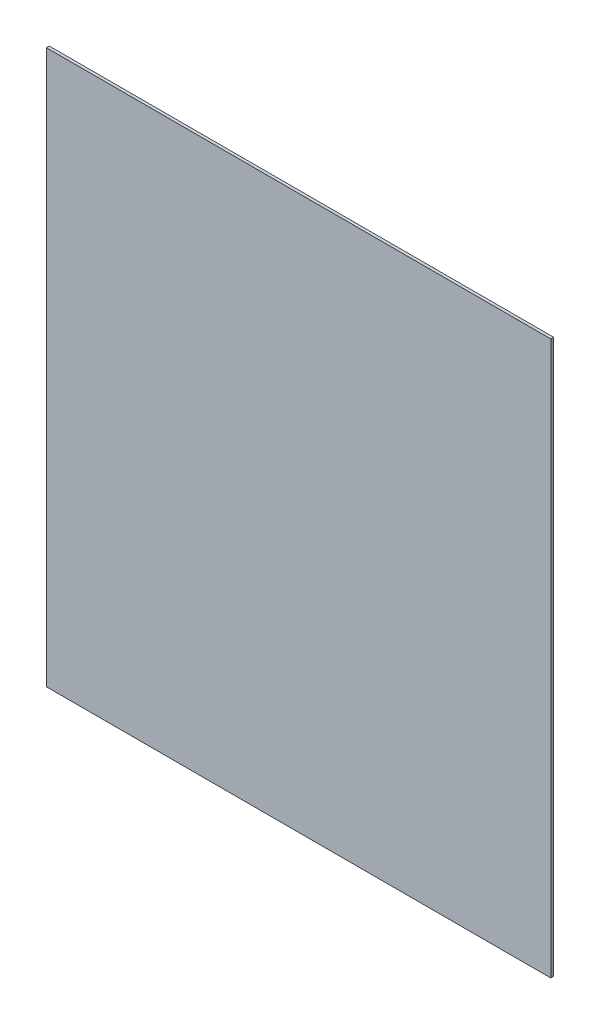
ISO-10303-21;
HEADER;
FILE_DESCRIPTION(('STEP AP214'),'2;1');
FILE_NAME('part.step','',(''),(''),'','','');
FILE_SCHEMA(('AUTOMOTIVE_DESIGN { 1 0 10303 214 1 1 1 1 }'));
ENDSEC;
DATA;
#1=APPLICATION_CONTEXT('core data for automotive mechanical design processes');
#2=APPLICATION_PROTOCOL_DEFINITION('international standard','automotive_design',2000,#1);
#3=PRODUCT_CONTEXT('',#1,'mechanical');
#4=PRODUCT('Part','Part','',(#3));
#5=PRODUCT_RELATED_PRODUCT_CATEGORY('part','',(#4));
#6=PRODUCT_DEFINITION_FORMATION('','',#4);
#7=PRODUCT_DEFINITION_CONTEXT('part definition',#1,'design');
#8=PRODUCT_DEFINITION('design','',#6,#7);
#9=PRODUCT_DEFINITION_SHAPE('','',#8);
#10=(LENGTH_UNIT() NAMED_UNIT(*) SI_UNIT(.MILLI.,.METRE.));
#11=(NAMED_UNIT(*) PLANE_ANGLE_UNIT() SI_UNIT($,.RADIAN.));
#12=(NAMED_UNIT(*) SI_UNIT($,.STERADIAN.) SOLID_ANGLE_UNIT());
#13=UNCERTAINTY_MEASURE_WITH_UNIT(LENGTH_MEASURE(1.E-05),#10,'distance_accuracy_value','');
#14=(GEOMETRIC_REPRESENTATION_CONTEXT(3) GLOBAL_UNCERTAINTY_ASSIGNED_CONTEXT((#13)) GLOBAL_UNIT_ASSIGNED_CONTEXT((#10,
#11,#12)) REPRESENTATION_CONTEXT('',''));
#15=CARTESIAN_POINT('',(0.,0.,0.));
#16=DIRECTION('',(0.,0.,1.));
#17=DIRECTION('',(1.,0.,0.));
#18=AXIS2_PLACEMENT_3D('',#15,#16,#17);
#19=CARTESIAN_POINT('',(0.,0.,6.35000000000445));
#20=DIRECTION('',(0.,0.,1.));
#21=DIRECTION('',(0.,-1.,0.));
#22=AXIS2_PLACEMENT_3D('',#19,#20,#21);
#23=PLANE('',#22);
#24=DIRECTION('',(1.,0.,0.));
#25=VECTOR('',#24,1.);
#26=CARTESIAN_POINT('',(120.650000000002,-2116.90536834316,6.3499999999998));
#27=LINE('',#26,#25);
#28=CARTESIAN_POINT('',(-990.599999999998,-2116.90536834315,6.35000000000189));
#29=VERTEX_POINT('',#28);
#30=CARTESIAN_POINT('',(120.650000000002,-2116.90536834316,6.3499999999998));
#31=VERTEX_POINT('',#30);
#32=EDGE_CURVE('E70',#29,#31,#27,.T.);
#33=ORIENTED_EDGE('',*,*,#32,.T.);
#34=DIRECTION('',(0.,1.,0.));
#35=VECTOR('',#34,1.);
#36=CARTESIAN_POINT('',(120.650000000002,-2116.90536834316,6.3499999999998));
#37=LINE('',#36,#35);
#38=CARTESIAN_POINT('',(120.650000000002,-897.705368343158,6.35000000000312));
#39=VERTEX_POINT('',#38);
#40=EDGE_CURVE('E42',#31,#39,#37,.T.);
#41=ORIENTED_EDGE('',*,*,#40,.T.);
#42=DIRECTION('',(-1.,0.,0.));
#43=VECTOR('',#42,1.);
#44=CARTESIAN_POINT('',(120.650000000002,-897.705368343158,6.35000000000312));
#45=LINE('',#44,#43);
#46=CARTESIAN_POINT('',(-990.599999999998,-897.705368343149,6.35000000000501));
#47=VERTEX_POINT('',#46);
#48=EDGE_CURVE('E76',#39,#47,#45,.T.);
#49=ORIENTED_EDGE('',*,*,#48,.T.);
#50=DIRECTION('',(0.,-1.,0.));
#51=VECTOR('',#50,1.);
#52=CARTESIAN_POINT('',(-990.599999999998,-2116.90536834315,6.35000000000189));
#53=LINE('',#52,#51);
#54=EDGE_CURVE('E73',#47,#29,#53,.T.);
#55=ORIENTED_EDGE('',*,*,#54,.T.);
#56=EDGE_LOOP('',(#33,#41,#49,#55));
#57=FACE_BOUND('',#56,.T.);
#58=ADVANCED_FACE('F33',(#57),#23,.T.);
#59=CARTESIAN_POINT('',(0.,0.,4.45063687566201E-12));
#60=DIRECTION('',(0.,0.,1.));
#61=DIRECTION('',(0.,-1.,0.));
#62=AXIS2_PLACEMENT_3D('',#59,#60,#61);
#63=PLANE('',#62);
#64=DIRECTION('',(1.,0.,0.));
#65=VECTOR('',#64,1.);
#66=CARTESIAN_POINT('',(120.650000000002,-2116.90536834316,-1.97417111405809E-13));
#67=LINE('',#66,#65);
#68=CARTESIAN_POINT('',(-990.599999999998,-2116.90536834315,1.89028853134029E-12));
#69=VERTEX_POINT('',#68);
#70=CARTESIAN_POINT('',(120.650000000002,-2116.90536834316,-1.97417111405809E-13));
#71=VERTEX_POINT('',#70);
#72=EDGE_CURVE('E90',#69,#71,#67,.T.);
#73=ORIENTED_EDGE('',*,*,#72,.F.);
#74=DIRECTION('',(0.,-1.,0.));
#75=VECTOR('',#74,1.);
#76=CARTESIAN_POINT('',(-990.599999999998,-2116.90536834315,1.89028853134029E-12));
#77=LINE('',#76,#75);
#78=CARTESIAN_POINT('',(-990.599999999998,-897.705368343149,5.01225870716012E-12));
#79=VERTEX_POINT('',#78);
#80=EDGE_CURVE('E87',#79,#69,#77,.T.);
#81=ORIENTED_EDGE('',*,*,#80,.F.);
#82=DIRECTION('',(-1.,0.,0.));
#83=VECTOR('',#82,1.);
#84=CARTESIAN_POINT('',(120.650000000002,-897.705368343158,3.11852813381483E-12));
#85=LINE('',#84,#83);
#86=CARTESIAN_POINT('',(120.650000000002,-897.705368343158,3.11852813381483E-12));
#87=VERTEX_POINT('',#86);
#88=EDGE_CURVE('E51',#87,#79,#85,.T.);
#89=ORIENTED_EDGE('',*,*,#88,.F.);
#90=DIRECTION('',(0.,1.,0.));
#91=VECTOR('',#90,1.);
#92=CARTESIAN_POINT('',(120.650000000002,-2116.90536834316,-1.97417111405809E-13));
#93=LINE('',#92,#91);
#94=EDGE_CURVE('E12',#71,#87,#93,.T.);
#95=ORIENTED_EDGE('',*,*,#94,.F.);
#96=EDGE_LOOP('',(#73,#81,#89,#95));
#97=FACE_BOUND('',#96,.T.);
#98=ADVANCED_FACE('F129',(#97),#63,.F.);
#99=CARTESIAN_POINT('',(120.650000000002,-2116.90536834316,-1.97417111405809E-13));
#100=DIRECTION('',(0.,-1.,0.));
#101=DIRECTION('',(1.,0.,0.));
#102=AXIS2_PLACEMENT_3D('',#99,#100,#101);
#103=PLANE('',#102);
#104=ORIENTED_EDGE('',*,*,#32,.F.);
#105=DIRECTION('',(0.,0.,1.));
#106=VECTOR('',#105,1.);
#107=CARTESIAN_POINT('',(-990.599999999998,-2116.90536834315,1.89028853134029E-12));
#108=LINE('',#107,#106);
#109=EDGE_CURVE('E85',#69,#29,#108,.T.);
#110=ORIENTED_EDGE('',*,*,#109,.F.);
#111=ORIENTED_EDGE('',*,*,#72,.T.);
#112=DIRECTION('',(0.,0.,1.));
#113=VECTOR('',#112,1.);
#114=CARTESIAN_POINT('',(120.650000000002,-2116.90536834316,-1.97417111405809E-13));
#115=LINE('',#114,#113);
#116=EDGE_CURVE('E81',#71,#31,#115,.T.);
#117=ORIENTED_EDGE('',*,*,#116,.T.);
#118=EDGE_LOOP('',(#104,#110,#111,#117));
#119=FACE_BOUND('',#118,.T.);
#120=ADVANCED_FACE('F91',(#119),#103,.T.);
#121=CARTESIAN_POINT('',(-990.599999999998,-2116.90536834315,1.89028853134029E-12));
#122=DIRECTION('',(-1.,0.,0.));
#123=DIRECTION('',(0.,-1.,0.));
#124=AXIS2_PLACEMENT_3D('',#121,#122,#123);
#125=PLANE('',#124);
#126=ORIENTED_EDGE('',*,*,#54,.F.);
#127=DIRECTION('',(0.,0.,1.));
#128=VECTOR('',#127,1.);
#129=CARTESIAN_POINT('',(-990.599999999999,-897.705368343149,5.01225870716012E-12));
#130=LINE('',#129,#128);
#131=EDGE_CURVE('E80',#79,#47,#130,.T.);
#132=ORIENTED_EDGE('',*,*,#131,.F.);
#133=ORIENTED_EDGE('',*,*,#80,.T.);
#134=ORIENTED_EDGE('',*,*,#109,.T.);
#135=EDGE_LOOP('',(#126,#132,#133,#134));
#136=FACE_BOUND('',#135,.T.);
#137=ADVANCED_FACE('F86',(#136),#125,.T.);
#138=CARTESIAN_POINT('',(120.650000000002,-897.705368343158,3.11852813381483E-12));
#139=DIRECTION('',(0.,1.,0.));
#140=DIRECTION('',(-1.,0.,0.));
#141=AXIS2_PLACEMENT_3D('',#138,#139,#140);
#142=PLANE('',#141);
#143=ORIENTED_EDGE('',*,*,#48,.F.);
#144=DIRECTION('',(0.,0.,1.));
#145=VECTOR('',#144,1.);
#146=CARTESIAN_POINT('',(120.650000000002,-897.705368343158,3.11852813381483E-12));
#147=LINE('',#146,#145);
#148=EDGE_CURVE('E105',#87,#39,#147,.T.);
#149=ORIENTED_EDGE('',*,*,#148,.F.);
#150=ORIENTED_EDGE('',*,*,#88,.T.);
#151=ORIENTED_EDGE('',*,*,#131,.T.);
#152=EDGE_LOOP('',(#143,#149,#150,#151));
#153=FACE_BOUND('',#152,.T.);
#154=ADVANCED_FACE('F116',(#153),#142,.T.);
#155=CARTESIAN_POINT('',(120.650000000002,-2116.90536834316,-1.97417111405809E-13));
#156=DIRECTION('',(1.,0.,0.));
#157=DIRECTION('',(0.,1.,0.));
#158=AXIS2_PLACEMENT_3D('',#155,#156,#157);
#159=PLANE('',#158);
#160=ORIENTED_EDGE('',*,*,#40,.F.);
#161=ORIENTED_EDGE('',*,*,#116,.F.);
#162=ORIENTED_EDGE('',*,*,#94,.T.);
#163=ORIENTED_EDGE('',*,*,#148,.T.);
#164=EDGE_LOOP('',(#160,#161,#162,#163));
#165=FACE_BOUND('',#164,.T.);
#166=ADVANCED_FACE('F131',(#165),#159,.T.);
#167=CLOSED_SHELL('',(#58,#98,#120,#137,#154,#166));
#168=MANIFOLD_SOLID_BREP('B2',#167);
#169=ADVANCED_BREP_SHAPE_REPRESENTATION('',(#18,#168),#14);
#170=SHAPE_DEFINITION_REPRESENTATION(#9,#169);
ENDSEC;
END-ISO-10303-21;
